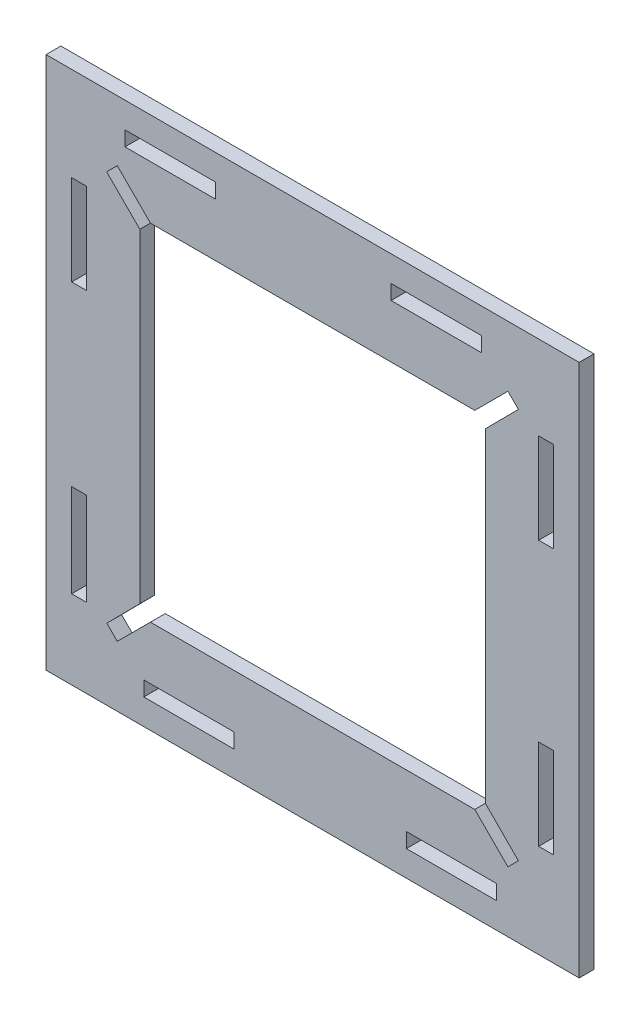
from build123d import *

# Parameters (mm, degrees)
SKETCH1_W           = 108
SKETCH1_H           = 108
SKETCH1_W_2         = 18.3
SKETCH1_H_2         = 3
SKETCH1_W_3         = 3
SKETCH1_H_3         = 18.3
SKETCH1_H_4         = 18.8
BOSS_EXTRUDE1_DEPTH = 3


with BuildPart() as part:
    # Sketch1 → Boss-Extrude1 (new body)
    with BuildSketch(Plane.XY):
        Rectangle(SKETCH1_W, SKETCH1_H)
        with Locations((-28.85, 47.3)):
            Rectangle(SKETCH1_W_2, SKETCH1_H_2, mode=Mode.SUBTRACT)
        Polygon((-32.85, -35), (32.85, -35), (39.567453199, -41.717453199), (41.688773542, -39.596132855), (35, -32.85), (35, 32.85), (41.688834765, 39.596194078), (39.567514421, 41.717514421), (32.85, 35), (-32.85, 35), (-39.567514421, 41.717514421), (-41.717514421, 39.567514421), (-35, 32.85), (-35, -32.85), (-41.688773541, -39.596132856), (-39.567514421, -41.717514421), align=None, mode=Mode.SUBTRACT)
        with Locations((25.05, 47.3)):
            Rectangle(SKETCH1_W_2, SKETCH1_H_2, mode=Mode.SUBTRACT)
        with Locations((-25.05, -47.3)):
            Rectangle(SKETCH1_W_2, SKETCH1_H_2, mode=Mode.SUBTRACT)
        with Locations((28.15, -47.3)):
            Rectangle(SKETCH1_W_2, SKETCH1_H_2, mode=Mode.SUBTRACT)
        with Locations((-47.3, 25.85)):
            Rectangle(SKETCH1_W_3, SKETCH1_H_3, mode=Mode.SUBTRACT)
        with Locations((-47.3, -28.6)):
            Rectangle(SKETCH1_W_3, SKETCH1_H_4, mode=Mode.SUBTRACT)
        with Locations((47.3, -25.85)):
            Rectangle(SKETCH1_W_3, SKETCH1_H_3, mode=Mode.SUBTRACT)
        with Locations((47.3, 27.85)):
            Rectangle(SKETCH1_W_3, SKETCH1_H_3, mode=Mode.SUBTRACT)
    extrude(amount=BOSS_EXTRUDE1_DEPTH)


solid = part.part
